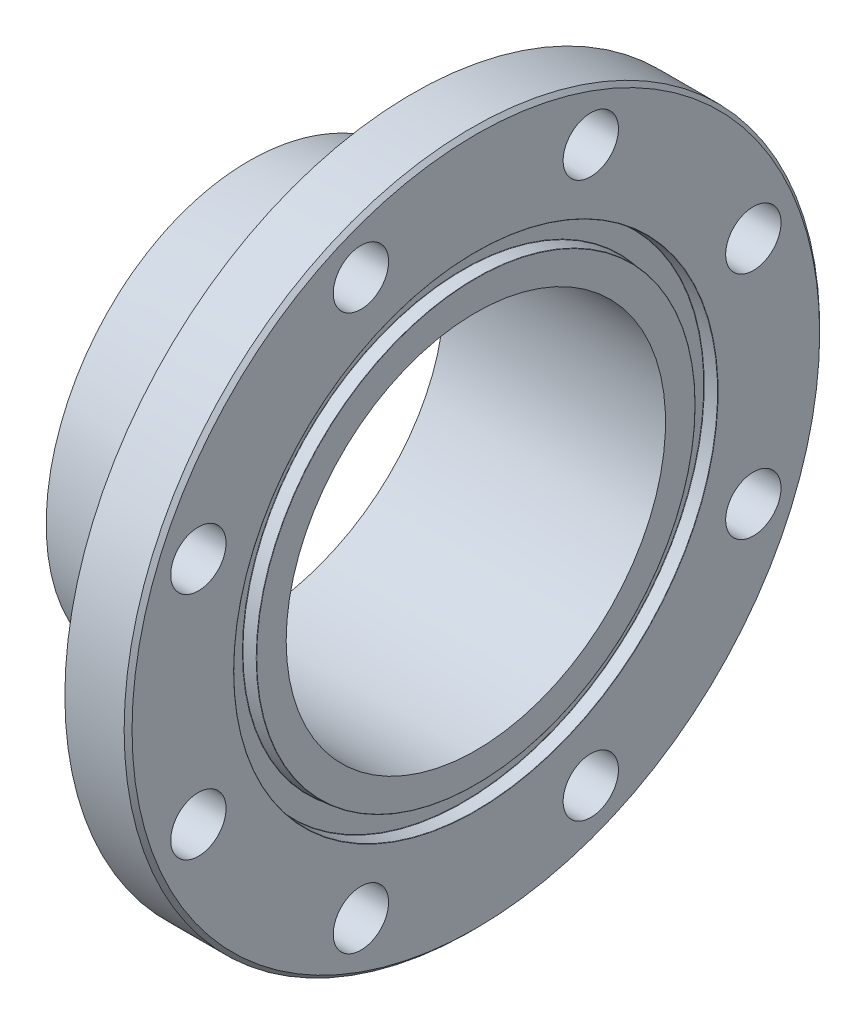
ISO-10303-21;
HEADER;
FILE_DESCRIPTION(('STEP AP214'),'2;1');
FILE_NAME('part.step','',(''),(''),'','','');
FILE_SCHEMA(('AUTOMOTIVE_DESIGN { 1 0 10303 214 1 1 1 1 }'));
ENDSEC;
DATA;
#1=APPLICATION_CONTEXT('core data for automotive mechanical design processes');
#2=APPLICATION_PROTOCOL_DEFINITION('international standard','automotive_design',2000,#1);
#3=PRODUCT_CONTEXT('',#1,'mechanical');
#4=PRODUCT('Part','Part','',(#3));
#5=PRODUCT_RELATED_PRODUCT_CATEGORY('part','',(#4));
#6=PRODUCT_DEFINITION_FORMATION('','',#4);
#7=PRODUCT_DEFINITION_CONTEXT('part definition',#1,'design');
#8=PRODUCT_DEFINITION('design','',#6,#7);
#9=PRODUCT_DEFINITION_SHAPE('','',#8);
#10=(LENGTH_UNIT() NAMED_UNIT(*) SI_UNIT(.MILLI.,.METRE.));
#11=(NAMED_UNIT(*) PLANE_ANGLE_UNIT() SI_UNIT($,.RADIAN.));
#12=(NAMED_UNIT(*) SI_UNIT($,.STERADIAN.) SOLID_ANGLE_UNIT());
#13=UNCERTAINTY_MEASURE_WITH_UNIT(LENGTH_MEASURE(1.E-05),#10,'distance_accuracy_value','');
#14=(GEOMETRIC_REPRESENTATION_CONTEXT(3) GLOBAL_UNCERTAINTY_ASSIGNED_CONTEXT((#13)) GLOBAL_UNIT_ASSIGNED_CONTEXT((#10,
#11,#12)) REPRESENTATION_CONTEXT('',''));
#15=CARTESIAN_POINT('',(0.,0.,0.));
#16=DIRECTION('',(0.,0.,1.));
#17=DIRECTION('',(1.,0.,0.));
#18=AXIS2_PLACEMENT_3D('',#15,#16,#17);
#19=CARTESIAN_POINT('',(0.,0.,0.));
#20=DIRECTION('',(-1.,0.,0.));
#21=DIRECTION('',(0.,0.,1.));
#22=AXIS2_PLACEMENT_3D('',#19,#20,#21);
#23=CYLINDRICAL_SURFACE('',#22,76.2);
#24=CARTESIAN_POINT('',(19.05,0.,76.2));
#25=CARTESIAN_POINT('',(19.0500001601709,1.06962037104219,76.2000012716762));
#26=CARTESIAN_POINT('',(19.0488733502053,2.13920445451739,76.1774764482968));
#27=CARTESIAN_POINT('',(19.0443743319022,4.27656395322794,76.087417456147));
#28=CARTESIAN_POINT('',(19.0410019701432,5.34433923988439,76.0198802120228));
#29=CARTESIAN_POINT('',(19.0320346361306,7.47627389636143,75.8398968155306));
#30=CARTESIAN_POINT('',(19.0264392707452,8.54043259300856,75.7274427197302));
#31=CARTESIAN_POINT('',(19.0130650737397,10.663157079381,75.4578149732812));
#32=CARTESIAN_POINT('',(19.0052860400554,11.7217223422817,75.3006371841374));
#33=CARTESIAN_POINT('',(18.9875911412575,13.8323230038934,74.9416696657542));
#34=CARTESIAN_POINT('',(18.9776731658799,14.8843508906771,74.7398358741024));
#35=CARTESIAN_POINT('',(18.9557744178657,16.9790417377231,74.2919869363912));
#36=CARTESIAN_POINT('',(18.9437934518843,18.0217038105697,74.0459676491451));
#37=CARTESIAN_POINT('',(18.9178565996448,20.0955426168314,73.5102437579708));
#38=CARTESIAN_POINT('',(18.9039010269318,21.1267211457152,73.2205460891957));
#39=CARTESIAN_POINT('',(18.8741113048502,23.1760231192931,72.5979261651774));
#40=CARTESIAN_POINT('',(18.8582769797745,24.1941453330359,72.264999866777));
#41=CARTESIAN_POINT('',(18.824853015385,26.2148396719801,71.5567447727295));
#42=CARTESIAN_POINT('',(18.8072644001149,27.2174204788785,71.1814406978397));
#43=CARTESIAN_POINT('',(18.7704473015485,29.2059495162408,70.3889068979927));
#44=CARTESIAN_POINT('',(18.7512186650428,30.1918961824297,69.9716732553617));
#45=CARTESIAN_POINT('',(18.7112609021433,32.1452366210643,69.0960867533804));
#46=CARTESIAN_POINT('',(18.6905318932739,33.1126318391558,68.6377371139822));
#47=CARTESIAN_POINT('',(18.6477172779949,35.0273181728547,67.6806666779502));
#48=CARTESIAN_POINT('',(18.6256315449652,35.9746074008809,67.1819421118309));
#49=CARTESIAN_POINT('',(18.580268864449,37.8470133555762,66.1452055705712));
#50=CARTESIAN_POINT('',(18.5569923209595,38.7721374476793,65.6072068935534));
#51=CARTESIAN_POINT('',(18.5094064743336,40.5989190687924,64.4927369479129));
#52=CARTESIAN_POINT('',(18.4850970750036,41.5005743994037,63.916262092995));
#53=CARTESIAN_POINT('',(18.4108804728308,44.1677332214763,62.1307234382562));
#54=CARTESIAN_POINT('',(18.3596723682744,45.8959395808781,60.8652630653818));
#55=CARTESIAN_POINT('',(18.2552173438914,49.2409447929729,58.1924256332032));
#56=CARTESIAN_POINT('',(18.2019686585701,50.8576436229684,56.7849238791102));
#57=CARTESIAN_POINT('',(18.0949770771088,53.9668181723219,53.8387273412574));
#58=CARTESIAN_POINT('',(18.0412341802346,55.4592937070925,52.3000323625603));
#59=CARTESIAN_POINT('',(17.934777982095,58.309412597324,49.102341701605));
#60=CARTESIAN_POINT('',(17.8820647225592,59.6670504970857,47.4433411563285));
#61=CARTESIAN_POINT('',(17.7791649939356,62.23781424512,44.0168357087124));
#62=CARTESIAN_POINT('',(17.7289785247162,63.4509401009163,42.249330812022));
#63=CARTESIAN_POINT('',(17.6325326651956,65.724632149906,38.6174209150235));
#64=CARTESIAN_POINT('',(17.5862752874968,66.7851203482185,36.752967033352));
#65=CARTESIAN_POINT('',(17.4990317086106,68.7452459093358,32.9412208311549));
#66=CARTESIAN_POINT('',(17.4580455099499,69.6448831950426,30.9939284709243));
#67=CARTESIAN_POINT('',(17.38251119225,71.2768765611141,27.0303563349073));
#68=CARTESIAN_POINT('',(17.347963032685,72.0092336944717,25.0140769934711));
#69=CARTESIAN_POINT('',(17.2862887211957,73.3014331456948,20.9268644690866));
#70=CARTESIAN_POINT('',(17.2591625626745,73.8612756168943,18.8559313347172));
#71=CARTESIAN_POINT('',(17.2131250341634,74.8040347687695,14.6759265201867));
#72=CARTESIAN_POINT('',(17.1942067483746,75.187100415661,12.5668885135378));
#73=CARTESIAN_POINT('',(17.1650904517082,75.7742569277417,8.32398482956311));
#74=CARTESIAN_POINT('',(17.1548924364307,75.9783478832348,6.19011916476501));
#75=CARTESIAN_POINT('',(17.1435072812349,76.2060900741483,1.91277189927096));
#76=CARTESIAN_POINT('',(17.1423200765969,76.2297426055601,-0.230709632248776));
#77=CARTESIAN_POINT('',(17.1489902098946,76.096441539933,-4.51203468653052));
#78=CARTESIAN_POINT('',(17.1568475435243,75.9394880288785,-6.64987821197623));
#79=CARTESIAN_POINT('',(17.1813717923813,75.4463235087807,-10.9027873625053));
#80=CARTESIAN_POINT('',(17.1980307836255,75.1102737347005,-13.0178717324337));
#81=CARTESIAN_POINT('',(17.2396798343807,74.2614227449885,-17.2121843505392));
#82=CARTESIAN_POINT('',(17.2646698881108,73.7486216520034,-19.2914126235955));
#83=CARTESIAN_POINT('',(17.3222710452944,72.5499309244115,-23.3992598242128));
#84=CARTESIAN_POINT('',(17.3548821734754,71.8640407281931,-25.4278785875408));
#85=CARTESIAN_POINT('',(17.4267994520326,70.3240655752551,-29.4201152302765));
#86=CARTESIAN_POINT('',(17.4661056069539,69.46998050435,-31.3837330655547));
#87=CARTESIAN_POINT('',(17.5503168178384,67.5992736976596,-35.2329281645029));
#88=CARTESIAN_POINT('',(17.595224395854,66.5825786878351,-37.1184697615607));
#89=CARTESIAN_POINT('',(17.6893503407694,64.3941588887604,-40.7972168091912));
#90=CARTESIAN_POINT('',(17.7385687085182,63.2224340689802,-42.59042224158));
#91=CARTESIAN_POINT('',(17.8399212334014,60.7322645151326,-46.0718171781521));
#92=CARTESIAN_POINT('',(17.8920554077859,59.4138189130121,-47.7600060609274));
#93=CARTESIAN_POINT('',(17.9977623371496,56.6395572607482,-51.0194142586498));
#94=CARTESIAN_POINT('',(18.0513350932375,55.1837411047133,-52.5906334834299));
#95=CARTESIAN_POINT('',(18.1584610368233,52.1433753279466,-55.6066404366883));
#96=CARTESIAN_POINT('',(18.2120141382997,50.5586861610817,-57.0512874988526));
#97=CARTESIAN_POINT('',(18.3175225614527,47.273199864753,-59.8019626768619));
#98=CARTESIAN_POINT('',(18.3694778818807,45.5724026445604,-61.1079906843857));
#99=CARTESIAN_POINT('',(18.470316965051,42.0667581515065,-63.5721500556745));
#100=CARTESIAN_POINT('',(18.5192007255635,40.2619108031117,-64.7302813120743));
#101=CARTESIAN_POINT('',(18.6125098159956,36.5609696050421,-66.8904049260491));
#102=CARTESIAN_POINT('',(18.6569351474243,34.6648757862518,-67.8923973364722));
#103=CARTESIAN_POINT('',(18.7400680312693,30.7948402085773,-69.7331292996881));
#104=CARTESIAN_POINT('',(18.7787754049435,28.8208960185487,-70.5718637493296));
#105=CARTESIAN_POINT('',(18.8493718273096,24.8092431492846,-72.0800488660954));
#106=CARTESIAN_POINT('',(18.8812608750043,22.7715344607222,-72.7494995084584));
#107=CARTESIAN_POINT('',(18.9373147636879,18.6468637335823,-73.9143211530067));
#108=CARTESIAN_POINT('',(18.9614796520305,16.55990199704,-74.4096932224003));
#109=CARTESIAN_POINT('',(19.0013988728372,12.3515785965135,-75.2228108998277));
#110=CARTESIAN_POINT('',(19.0171532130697,10.2302169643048,-75.5405566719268));
#111=CARTESIAN_POINT('',(19.0397913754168,5.9705219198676,-75.995894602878));
#112=CARTESIAN_POINT('',(19.0466847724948,3.83220934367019,-76.133681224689));
#113=CARTESIAN_POINT('',(19.0514369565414,-0.448433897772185,-76.2287487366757));
#114=CARTESIAN_POINT('',(19.0492957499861,-2.59076456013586,-76.1860297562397));
#115=CARTESIAN_POINT('',(19.0360394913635,-6.86418936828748,-75.9203930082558));
#116=CARTESIAN_POINT('',(19.0249244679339,-8.99528354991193,-75.6974758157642));
#117=CARTESIAN_POINT('',(18.9940358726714,-13.2310790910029,-75.0730412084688));
#118=CARTESIAN_POINT('',(18.9742623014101,-15.3357804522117,-74.6715238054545));
#119=CARTESIAN_POINT('',(18.9266294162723,-19.5027678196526,-73.6930122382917));
#120=CARTESIAN_POINT('',(18.8987742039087,-21.5650747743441,-73.1161070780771));
#121=CARTESIAN_POINT('',(18.8357629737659,-25.6337366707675,-71.7908706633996));
#122=CARTESIAN_POINT('',(18.8006069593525,-27.6400916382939,-71.0425394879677));
#123=CARTESIAN_POINT('',(18.7239890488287,-31.5826375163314,-69.3797819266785));
#124=CARTESIAN_POINT('',(18.6825271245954,-33.5188281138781,-68.4653548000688));
#125=CARTESIAN_POINT('',(18.594470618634,-37.3073282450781,-66.4769127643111));
#126=CARTESIAN_POINT('',(18.5478760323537,-39.159637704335,-65.402897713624));
#127=CARTESIAN_POINT('',(18.4508305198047,-42.7688189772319,-63.1019192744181));
#128=CARTESIAN_POINT('',(18.4003763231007,-44.5256076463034,-61.8748256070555));
#129=CARTESIAN_POINT('',(18.297075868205,-47.9295939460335,-59.2771273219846));
#130=CARTESIAN_POINT('',(18.244229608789,-49.5767915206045,-57.9065226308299));
#131=CARTESIAN_POINT('',(18.1376417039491,-52.7499426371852,-55.0315111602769));
#132=CARTESIAN_POINT('',(18.0839000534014,-54.2758954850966,-53.5271036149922));
#133=CARTESIAN_POINT('',(17.9770442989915,-57.195739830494,-50.3951486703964));
#134=CARTESIAN_POINT('',(17.923930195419,-58.589631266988,-48.7676012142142));
#135=CARTESIAN_POINT('',(17.8197888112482,-61.2366466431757,-45.3993947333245));
#136=CARTESIAN_POINT('',(17.7687634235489,-62.4896446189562,-43.6586366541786));
#137=CARTESIAN_POINT('',(17.6702991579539,-64.8445374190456,-40.0776522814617));
#138=CARTESIAN_POINT('',(17.6228602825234,-65.9464321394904,-38.2374259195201));
#139=CARTESIAN_POINT('',(17.5329180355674,-67.9912658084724,-34.470572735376));
#140=CARTESIAN_POINT('',(17.4904146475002,-68.9342052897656,-32.5439462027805));
#141=CARTESIAN_POINT('',(17.4115527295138,-70.6544026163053,-28.6179744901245));
#142=CARTESIAN_POINT('',(17.3751941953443,-71.4316605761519,-26.6186293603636));
#143=CARTESIAN_POINT('',(17.3096728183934,-72.8146133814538,-22.5623878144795));
#144=CARTESIAN_POINT('',(17.2805066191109,-73.4203882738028,-20.5055187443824));
#145=CARTESIAN_POINT('',(17.2301784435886,-74.4565222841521,-16.347965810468));
#146=CARTESIAN_POINT('',(17.2090164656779,-74.88688143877,-14.2472819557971));
#147=CARTESIAN_POINT('',(17.1752998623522,-75.5690967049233,-10.0170672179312));
#148=CARTESIAN_POINT('',(17.1627451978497,-75.8209536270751,-7.88753646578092));
#149=CARTESIAN_POINT('',(17.1466010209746,-76.1443595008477,-3.6147939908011));
#150=CARTESIAN_POINT('',(17.1430115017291,-76.2159085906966,-1.47158227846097));
#151=CARTESIAN_POINT('',(17.1448988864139,-76.178206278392,2.81089507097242));
#152=CARTESIAN_POINT('',(17.1503658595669,-76.069152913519,4.95016245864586));
#153=CARTESIAN_POINT('',(17.1701917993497,-75.6714030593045,9.21188799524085));
#154=CARTESIAN_POINT('',(17.1845507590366,-75.382706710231,11.334346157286));
#155=CARTESIAN_POINT('',(17.2217522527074,-74.6277377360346,15.5473680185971));
#156=CARTESIAN_POINT('',(17.2445947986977,-74.161464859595,17.6379316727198));
#157=CARTESIAN_POINT('',(17.2981140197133,-73.0546780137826,21.7723116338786));
#158=CARTESIAN_POINT('',(17.3287906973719,-72.4141639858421,23.8161279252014));
#159=CARTESIAN_POINT('',(17.3971068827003,-70.9634625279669,27.8425229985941));
#160=CARTESIAN_POINT('',(17.4347464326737,-70.1532740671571,29.8251014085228));
#161=CARTESIAN_POINT('',(17.5159195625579,-68.3690049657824,33.7149506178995));
#162=CARTESIAN_POINT('',(17.5594531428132,-67.3949243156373,35.6222214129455));
#163=CARTESIAN_POINT('',(17.651178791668,-65.2898121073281,39.3479107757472));
#164=CARTESIAN_POINT('',(17.699370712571,-64.1587855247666,41.166332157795));
#165=CARTESIAN_POINT('',(17.7990460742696,-61.7478585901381,44.7014555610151));
#166=CARTESIAN_POINT('',(17.8505295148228,-60.4679582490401,46.4181575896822));
#167=CARTESIAN_POINT('',(17.9553908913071,-57.7667507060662,49.7395961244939));
#168=CARTESIAN_POINT('',(18.0087706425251,-56.3453055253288,51.3442207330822));
#169=CARTESIAN_POINT('',(18.0890714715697,-54.1159890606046,53.6567584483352));
#170=CARTESIAN_POINT('',(18.1158806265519,-53.3565817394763,54.4119678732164));
#171=CARTESIAN_POINT('',(18.1693891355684,-51.8066356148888,55.8896990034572));
#172=CARTESIAN_POINT('',(18.1960884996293,-51.0160997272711,56.6122237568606));
#173=CARTESIAN_POINT('',(18.2491973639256,-49.405010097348,58.0235503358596));
#174=CARTESIAN_POINT('',(18.2756067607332,-48.5844460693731,58.7123404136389));
#175=CARTESIAN_POINT('',(18.3279368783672,-46.9150753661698,60.0546642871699));
#176=CARTESIAN_POINT('',(18.3538576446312,-46.0662713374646,60.7082013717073));
#177=CARTESIAN_POINT('',(18.4050308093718,-44.341789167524,61.9789723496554));
#178=CARTESIAN_POINT('',(18.4302831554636,-43.4661089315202,62.5962034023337));
#179=CARTESIAN_POINT('',(18.4799357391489,-41.6895722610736,63.7931551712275));
#180=CARTESIAN_POINT('',(18.5043360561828,-40.7887181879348,64.3728793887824));
#181=CARTESIAN_POINT('',(18.5521383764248,-38.9624129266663,65.4944263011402));
#182=CARTESIAN_POINT('',(18.5755393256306,-38.036937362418,66.0362093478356));
#183=CARTESIAN_POINT('',(18.6211475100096,-36.1640132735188,67.0802018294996));
#184=CARTESIAN_POINT('',(18.6433548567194,-35.2165668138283,67.5824149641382));
#185=CARTESIAN_POINT('',(18.6864235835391,-33.3011490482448,68.5465041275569));
#186=CARTESIAN_POINT('',(18.7072847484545,-32.3331744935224,69.0083737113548));
#187=CARTESIAN_POINT('',(18.7475068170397,-30.3786610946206,69.8908187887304));
#188=CARTESIAN_POINT('',(18.7668678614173,-29.3921240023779,70.3113981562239));
#189=CARTESIAN_POINT('',(18.8039355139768,-27.4031449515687,71.1101611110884));
#190=CARTESIAN_POINT('',(18.8216437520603,-26.4007198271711,71.4883865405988));
#191=CARTESIAN_POINT('',(18.8553001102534,-24.3808835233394,72.2022142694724));
#192=CARTESIAN_POINT('',(18.8712483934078,-23.3634737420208,72.537820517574));
#193=CARTESIAN_POINT('',(18.9012707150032,-21.3155624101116,73.165795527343));
#194=CARTESIAN_POINT('',(18.9153450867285,-20.2850632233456,73.4581719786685));
#195=CARTESIAN_POINT('',(18.9415219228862,-18.2127236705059,73.9992130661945));
#196=CARTESIAN_POINT('',(18.9536245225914,-17.1708840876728,74.2478807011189));
#197=CARTESIAN_POINT('',(18.9787005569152,-14.8008926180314,74.7609966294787));
#198=CARTESIAN_POINT('',(18.9910585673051,-13.4698534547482,75.0122417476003));
#199=CARTESIAN_POINT('',(19.0123422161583,-10.796573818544,75.44340124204));
#200=CARTESIAN_POINT('',(19.0212686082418,-9.45433587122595,75.6233312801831));
#201=CARTESIAN_POINT('',(19.0355921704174,-6.76216290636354,75.911434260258));
#202=CARTESIAN_POINT('',(19.0409893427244,-5.41222789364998,76.0196072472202));
#203=CARTESIAN_POINT('',(19.0481935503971,-2.70817643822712,76.1638972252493));
#204=CARTESIAN_POINT('',(19.0499997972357,-1.35405914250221,76.1999983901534));
#205=CARTESIAN_POINT('',(19.05,0.,76.2));
#206=B_SPLINE_CURVE_WITH_KNOTS('',3,(#24,#25,#26,#27,#28,#29,#30,#31,#32,#33,#34,#35,#36,#37,
#38,#39,#40,#41,#42,#43,#44,#45,#46,#47,#48,#49,#50,#51,#52,#53,#54,#55,#56,#57,#58,#59,#60,#61,
#62,#63,#64,#65,#66,#67,#68,#69,#70,#71,#72,#73,#74,#75,#76,#77,#78,#79,#80,#81,#82,#83,#84,#85,
#86,#87,#88,#89,#90,#91,#92,#93,#94,#95,#96,#97,#98,#99,#100,#101,#102,#103,#104,#105,#106,#107,
#108,#109,#110,#111,#112,#113,#114,#115,#116,#117,#118,#119,#120,#121,#122,#123,#124,#125,#126,
#127,#128,#129,#130,#131,#132,#133,#134,#135,#136,#137,#138,#139,#140,#141,#142,#143,#144,#145,
#146,#147,#148,#149,#150,#151,#152,#153,#154,#155,#156,#157,#158,#159,#160,#161,#162,#163,#164,
#165,#166,#167,#168,#169,#170,#171,#172,#173,#174,#175,#176,#177,#178,#179,#180,#181,#182,#183,
#184,#185,#186,#187,#188,#189,#190,#191,#192,#193,#194,#195,#196,#197,#198,#199,#200,#201,#202,
#203,#204,#205),.UNSPECIFIED.,.T.,.F.,(4,2,2,2,2,2,2,2,2,2,2,2,2,2,2,2,2,2,2,2,2,2,2,2,2,2,2,2,
2,2,2,2,2,2,2,2,2,2,2,2,2,2,2,2,2,2,2,2,2,2,2,2,2,2,2,2,2,2,2,2,2,2,2,2,2,2,2,2,2,2,2,2,2,2,2,2,
2,2,2,2,2,2,2,2,2,2,2,2,2,2,4),(0.,3.2085606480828,6.41734053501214,9.6266881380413,
12.8363328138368,16.0491587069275,19.2622858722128,22.4749034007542,25.6878216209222,
28.8988751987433,32.1102290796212,35.3213316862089,38.5327344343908,41.743054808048,
44.9536748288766,51.37317090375,57.7983523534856,64.2235433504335,70.6489942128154,
77.0744447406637,83.5031669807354,89.9318923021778,96.3605771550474,102.789256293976,
109.212508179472,115.63575682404,122.058959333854,128.482158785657,134.899585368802,
141.317007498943,147.73445045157,154.151897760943,160.572245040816,166.992593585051,
173.412980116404,179.833371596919,186.260810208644,192.688253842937,199.115702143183,
205.543148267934,211.970795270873,218.398443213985,224.826051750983,231.253654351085,
237.674305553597,244.094952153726,250.515578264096,256.936203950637,263.353576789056,
269.770946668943,276.188345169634,282.605749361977,289.028652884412,295.451559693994,
301.874503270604,308.297449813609,314.726093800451,321.154742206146,327.583369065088,
334.011991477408,340.437608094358,346.863223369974,353.288809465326,359.71439063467,
366.13293058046,372.551465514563,378.970009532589,385.388555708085,391.80714088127,
398.225726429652,404.64410853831,411.06249017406,417.487190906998,420.700419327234,
423.913347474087,427.12738665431,430.341125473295,433.555115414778,436.768804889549,
439.985804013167,443.20250199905,446.419712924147,449.636621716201,452.850323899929,
456.063728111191,459.276560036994,462.489171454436,466.550971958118,470.611879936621,
474.672785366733,478.734582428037),.UNSPECIFIED.);
#207=CARTESIAN_POINT('',(19.05,0.,76.2));
#208=VERTEX_POINT('',#207);
#209=EDGE_CURVE('E68',#208,#208,#206,.T.);
#210=ORIENTED_EDGE('',*,*,#209,.T.);
#211=EDGE_LOOP('',(#210));
#212=FACE_BOUND('',#211,.T.);
#213=CARTESIAN_POINT('',(107.95,0.,0.));
#214=DIRECTION('',(-1.,0.,0.));
#215=DIRECTION('',(0.,0.,1.));
#216=AXIS2_PLACEMENT_3D('',#213,#214,#215);
#217=CIRCLE('',#216,76.2);
#218=CARTESIAN_POINT('',(107.95,0.,76.2));
#219=VERTEX_POINT('',#218);
#220=EDGE_CURVE('E51',#219,#219,#217,.T.);
#221=ORIENTED_EDGE('',*,*,#220,.F.);
#222=EDGE_LOOP('',(#221));
#223=FACE_BOUND('',#222,.T.);
#224=ADVANCED_FACE('F31',(#212,#223),#23,.F.);
#225=CARTESIAN_POINT('',(107.95,0.,-76.2));
#226=DIRECTION('',(-1.,0.,0.));
#227=DIRECTION('',(0.,0.,1.));
#228=AXIS2_PLACEMENT_3D('',#225,#226,#227);
#229=PLANE('',#228);
#230=CARTESIAN_POINT('',(107.95,0.,0.));
#231=DIRECTION('',(-1.,0.,0.));
#232=DIRECTION('',(0.,0.,1.));
#233=AXIS2_PLACEMENT_3D('',#230,#231,#232);
#234=CIRCLE('',#233,88.0194613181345);
#235=CARTESIAN_POINT('',(107.95,0.,88.0194613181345));
#236=VERTEX_POINT('',#235);
#237=EDGE_CURVE('E145',#236,#236,#234,.T.);
#238=ORIENTED_EDGE('',*,*,#237,.F.);
#239=EDGE_LOOP('',(#238));
#240=FACE_BOUND('',#239,.T.);
#241=ORIENTED_EDGE('',*,*,#220,.T.);
#242=EDGE_LOOP('',(#241));
#243=FACE_BOUND('',#242,.T.);
#244=ADVANCED_FACE('F95',(#240,#243),#229,.F.);
#245=CARTESIAN_POINT('',(107.823,0.,0.));
#246=DIRECTION('',(-1.,0.,0.));
#247=DIRECTION('',(0.,0.,1.));
#248=AXIS2_PLACEMENT_3D('',#245,#246,#247);
#249=TOROIDAL_SURFACE('',#248,88.0194613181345,0.127000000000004);
#250=CARTESIAN_POINT('',(107.834068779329,0.,0.));
#251=DIRECTION('',(-1.,0.,0.));
#252=DIRECTION('',(0.,0.,1.));
#253=AXIS2_PLACEMENT_3D('',#250,#251,#252);
#254=CIRCLE('',#253,88.1459780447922);
#255=CARTESIAN_POINT('',(107.834068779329,0.,88.1459780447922));
#256=VERTEX_POINT('',#255);
#257=EDGE_CURVE('E143',#256,#256,#254,.T.);
#258=ORIENTED_EDGE('',*,*,#257,.F.);
#259=EDGE_LOOP('',(#258));
#260=FACE_BOUND('',#259,.T.);
#261=ORIENTED_EDGE('',*,*,#237,.T.);
#262=EDGE_LOOP('',(#261));
#263=FACE_BOUND('',#262,.T.);
#264=ADVANCED_FACE('F154',(#260,#263),#249,.T.);
#265=CARTESIAN_POINT('',(107.834068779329,0.,0.));
#266=DIRECTION('',(-1.,0.,0.));
#267=DIRECTION('',(0.,0.,1.));
#268=AXIS2_PLACEMENT_3D('',#265,#266,#267);
#269=CONICAL_SURFACE('',#268,88.1459780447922,0.087266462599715);
#270=CARTESIAN_POINT('',(102.960531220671,0.,0.));
#271=DIRECTION('',(-1.,0.,0.));
#272=DIRECTION('',(0.,0.,1.));
#273=AXIS2_PLACEMENT_3D('',#270,#271,#272);
#274=CIRCLE('',#273,88.5723573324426);
#275=CARTESIAN_POINT('',(102.960531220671,0.,88.5723573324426));
#276=VERTEX_POINT('',#275);
#277=EDGE_CURVE('E140',#276,#276,#274,.T.);
#278=ORIENTED_EDGE('',*,*,#277,.F.);
#279=EDGE_LOOP('',(#278));
#280=FACE_BOUND('',#279,.T.);
#281=ORIENTED_EDGE('',*,*,#257,.T.);
#282=EDGE_LOOP('',(#281));
#283=FACE_BOUND('',#282,.T.);
#284=ADVANCED_FACE('F159',(#280,#283),#269,.T.);
#285=CARTESIAN_POINT('',(102.9716,0.,0.));
#286=DIRECTION('',(-1.,0.,0.));
#287=DIRECTION('',(0.,0.,1.));
#288=AXIS2_PLACEMENT_3D('',#285,#286,#287);
#289=TOROIDAL_SURFACE('',#288,88.6988740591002,0.127000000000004);
#290=CARTESIAN_POINT('',(102.8446,0.,0.));
#291=DIRECTION('',(-1.,0.,0.));
#292=DIRECTION('',(0.,0.,1.));
#293=AXIS2_PLACEMENT_3D('',#290,#291,#292);
#294=CIRCLE('',#293,88.6988740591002);
#295=CARTESIAN_POINT('',(102.8446,0.,88.6988740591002));
#296=VERTEX_POINT('',#295);
#297=EDGE_CURVE('E137',#296,#296,#294,.T.);
#298=ORIENTED_EDGE('',*,*,#297,.F.);
#299=EDGE_LOOP('',(#298));
#300=FACE_BOUND('',#299,.T.);
#301=ORIENTED_EDGE('',*,*,#277,.T.);
#302=EDGE_LOOP('',(#301));
#303=FACE_BOUND('',#302,.T.);
#304=ADVANCED_FACE('F164',(#300,#303),#289,.F.);
#305=CARTESIAN_POINT('',(102.8446,0.,-88.6988740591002));
#306=DIRECTION('',(-1.,0.,0.));
#307=DIRECTION('',(0.,0.,1.));
#308=AXIS2_PLACEMENT_3D('',#305,#306,#307);
#309=PLANE('',#308);
#310=CARTESIAN_POINT('',(102.8446,0.,0.));
#311=DIRECTION('',(-1.,0.,0.));
#312=DIRECTION('',(0.,0.,1.));
#313=AXIS2_PLACEMENT_3D('',#310,#311,#312);
#314=CIRCLE('',#313,96.6449259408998);
#315=CARTESIAN_POINT('',(102.8446,0.,96.6449259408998));
#316=VERTEX_POINT('',#315);
#317=EDGE_CURVE('E134',#316,#316,#314,.T.);
#318=ORIENTED_EDGE('',*,*,#317,.F.);
#319=EDGE_LOOP('',(#318));
#320=FACE_BOUND('',#319,.T.);
#321=ORIENTED_EDGE('',*,*,#297,.T.);
#322=EDGE_LOOP('',(#321));
#323=FACE_BOUND('',#322,.T.);
#324=ADVANCED_FACE('F171',(#320,#323),#309,.F.);
#325=CARTESIAN_POINT('',(102.9716,0.,0.));
#326=DIRECTION('',(-1.,0.,0.));
#327=DIRECTION('',(0.,0.,1.));
#328=AXIS2_PLACEMENT_3D('',#325,#326,#327);
#329=TOROIDAL_SURFACE('',#328,96.6449259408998,0.127000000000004);
#330=CARTESIAN_POINT('',(102.960531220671,0.,0.));
#331=DIRECTION('',(-1.,0.,0.));
#332=DIRECTION('',(0.,0.,1.));
#333=AXIS2_PLACEMENT_3D('',#330,#331,#332);
#334=CIRCLE('',#333,96.7714426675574);
#335=CARTESIAN_POINT('',(102.960531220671,0.,96.7714426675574));
#336=VERTEX_POINT('',#335);
#337=EDGE_CURVE('E129',#336,#336,#334,.T.);
#338=ORIENTED_EDGE('',*,*,#337,.F.);
#339=EDGE_LOOP('',(#338));
#340=FACE_BOUND('',#339,.T.);
#341=ORIENTED_EDGE('',*,*,#317,.T.);
#342=EDGE_LOOP('',(#341));
#343=FACE_BOUND('',#342,.T.);
#344=ADVANCED_FACE('F175',(#340,#343),#329,.F.);
#345=CARTESIAN_POINT('',(102.960531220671,0.,0.));
#346=DIRECTION('',(1.,0.,0.));
#347=DIRECTION('',(0.,0.,-1.));
#348=AXIS2_PLACEMENT_3D('',#345,#346,#347);
#349=CONICAL_SURFACE('',#348,96.7714426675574,0.0872664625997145);
#350=CARTESIAN_POINT('',(107.834068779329,0.,0.));
#351=DIRECTION('',(-1.,0.,0.));
#352=DIRECTION('',(0.,0.,1.));
#353=AXIS2_PLACEMENT_3D('',#350,#351,#352);
#354=CIRCLE('',#353,97.1978219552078);
#355=CARTESIAN_POINT('',(107.834068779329,0.,97.1978219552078));
#356=VERTEX_POINT('',#355);
#357=EDGE_CURVE('E125',#356,#356,#354,.T.);
#358=ORIENTED_EDGE('',*,*,#357,.F.);
#359=EDGE_LOOP('',(#358));
#360=FACE_BOUND('',#359,.T.);
#361=ORIENTED_EDGE('',*,*,#337,.T.);
#362=EDGE_LOOP('',(#361));
#363=FACE_BOUND('',#362,.T.);
#364=ADVANCED_FACE('F179',(#360,#363),#349,.F.);
#365=CARTESIAN_POINT('',(107.823,0.,0.));
#366=DIRECTION('',(-1.,0.,0.));
#367=DIRECTION('',(0.,0.,1.));
#368=AXIS2_PLACEMENT_3D('',#365,#366,#367);
#369=TOROIDAL_SURFACE('',#368,97.3243386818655,0.127000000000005);
#370=CARTESIAN_POINT('',(107.95,0.,0.));
#371=DIRECTION('',(-1.,0.,0.));
#372=DIRECTION('',(0.,0.,1.));
#373=AXIS2_PLACEMENT_3D('',#370,#371,#372);
#374=CIRCLE('',#373,97.3243386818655);
#375=CARTESIAN_POINT('',(107.95,0.,97.3243386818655));
#376=VERTEX_POINT('',#375);
#377=EDGE_CURVE('E123',#376,#376,#374,.T.);
#378=ORIENTED_EDGE('',*,*,#377,.F.);
#379=EDGE_LOOP('',(#378));
#380=FACE_BOUND('',#379,.T.);
#381=ORIENTED_EDGE('',*,*,#357,.T.);
#382=EDGE_LOOP('',(#381));
#383=FACE_BOUND('',#382,.T.);
#384=ADVANCED_FACE('F183',(#380,#383),#369,.T.);
#385=CARTESIAN_POINT('',(107.95,0.,-97.3243386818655));
#386=DIRECTION('',(-1.,0.,0.));
#387=DIRECTION('',(0.,0.,1.));
#388=AXIS2_PLACEMENT_3D('',#385,#386,#387);
#389=PLANE('',#388);
#390=CARTESIAN_POINT('',(107.95,0.,0.));
#391=DIRECTION('',(-1.,0.,0.));
#392=DIRECTION('',(0.,0.,1.));
#393=AXIS2_PLACEMENT_3D('',#390,#391,#392);
#394=CIRCLE('',#393,138.1125);
#395=CARTESIAN_POINT('',(107.95,0.,138.1125));
#396=VERTEX_POINT('',#395);
#397=EDGE_CURVE('E42',#396,#396,#394,.F.);
#398=ORIENTED_EDGE('',*,*,#397,.T.);
#399=EDGE_LOOP('',(#398));
#400=FACE_BOUND('',#399,.T.);
#401=CARTESIAN_POINT('',(107.95,111.466065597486,46.1707561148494));
#402=DIRECTION('',(1.,0.,0.));
#403=DIRECTION('',(0.,0.,-1.));
#404=AXIS2_PLACEMENT_3D('',#401,#402,#403);
#405=CIRCLE('',#404,11.1125);
#406=CARTESIAN_POINT('',(107.95,111.466065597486,35.0582561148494));
#407=VERTEX_POINT('',#406);
#408=EDGE_CURVE('E56',#407,#407,#405,.T.);
#409=ORIENTED_EDGE('',*,*,#408,.F.);
#410=EDGE_LOOP('',(#409));
#411=FACE_BOUND('',#410,.T.);
#412=CARTESIAN_POINT('',(107.95,111.466065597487,-46.170756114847));
#413=DIRECTION('',(1.,0.,0.));
#414=DIRECTION('',(0.,0.,-1.));
#415=AXIS2_PLACEMENT_3D('',#412,#413,#414);
#416=CIRCLE('',#415,11.1125);
#417=CARTESIAN_POINT('',(107.95,111.466065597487,-57.283256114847));
#418=VERTEX_POINT('',#417);
#419=EDGE_CURVE('E55',#418,#418,#416,.T.);
#420=ORIENTED_EDGE('',*,*,#419,.F.);
#421=EDGE_LOOP('',(#420));
#422=FACE_BOUND('',#421,.T.);
#423=CARTESIAN_POINT('',(107.95,46.170756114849,-111.466065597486));
#424=DIRECTION('',(1.,0.,0.));
#425=DIRECTION('',(0.,0.,-1.));
#426=AXIS2_PLACEMENT_3D('',#423,#424,#425);
#427=CIRCLE('',#426,11.1125);
#428=CARTESIAN_POINT('',(107.95,46.170756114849,-122.578565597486));
#429=VERTEX_POINT('',#428);
#430=EDGE_CURVE('E60',#429,#429,#427,.T.);
#431=ORIENTED_EDGE('',*,*,#430,.F.);
#432=EDGE_LOOP('',(#431));
#433=FACE_BOUND('',#432,.T.);
#434=CARTESIAN_POINT('',(107.95,-46.1707561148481,-111.466065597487));
#435=DIRECTION('',(1.,0.,0.));
#436=DIRECTION('',(0.,0.,-1.));
#437=AXIS2_PLACEMENT_3D('',#434,#435,#436);
#438=CIRCLE('',#437,11.1125);
#439=CARTESIAN_POINT('',(107.95,-46.1707561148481,-122.578565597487));
#440=VERTEX_POINT('',#439);
#441=EDGE_CURVE('E240',#440,#440,#438,.T.);
#442=ORIENTED_EDGE('',*,*,#441,.F.);
#443=EDGE_LOOP('',(#442));
#444=FACE_BOUND('',#443,.T.);
#445=CARTESIAN_POINT('',(107.95,-111.466065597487,-46.1707561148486));
#446=DIRECTION('',(1.,0.,0.));
#447=DIRECTION('',(0.,0.,-1.));
#448=AXIS2_PLACEMENT_3D('',#445,#446,#447);
#449=CIRCLE('',#448,11.1125);
#450=CARTESIAN_POINT('',(107.95,-111.466065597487,-57.2832561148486));
#451=VERTEX_POINT('',#450);
#452=EDGE_CURVE('E236',#451,#451,#449,.T.);
#453=ORIENTED_EDGE('',*,*,#452,.F.);
#454=EDGE_LOOP('',(#453));
#455=FACE_BOUND('',#454,.T.);
#456=CARTESIAN_POINT('',(107.95,-111.466065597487,46.1707561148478));
#457=DIRECTION('',(1.,0.,0.));
#458=DIRECTION('',(0.,0.,-1.));
#459=AXIS2_PLACEMENT_3D('',#456,#457,#458);
#460=CIRCLE('',#459,11.1125);
#461=CARTESIAN_POINT('',(107.95,-111.466065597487,35.0582561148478));
#462=VERTEX_POINT('',#461);
#463=EDGE_CURVE('E232',#462,#462,#460,.T.);
#464=ORIENTED_EDGE('',*,*,#463,.F.);
#465=EDGE_LOOP('',(#464));
#466=FACE_BOUND('',#465,.T.);
#467=CARTESIAN_POINT('',(107.95,-46.1707561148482,111.466065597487));
#468=DIRECTION('',(1.,0.,0.));
#469=DIRECTION('',(0.,0.,-1.));
#470=AXIS2_PLACEMENT_3D('',#467,#468,#469);
#471=CIRCLE('',#470,11.1125);
#472=CARTESIAN_POINT('',(107.95,-46.1707561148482,100.353565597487));
#473=VERTEX_POINT('',#472);
#474=EDGE_CURVE('E226',#473,#473,#471,.T.);
#475=ORIENTED_EDGE('',*,*,#474,.F.);
#476=EDGE_LOOP('',(#475));
#477=FACE_BOUND('',#476,.T.);
#478=CARTESIAN_POINT('',(107.95,46.1707561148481,111.466065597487));
#479=DIRECTION('',(1.,0.,0.));
#480=DIRECTION('',(0.,0.,-1.));
#481=AXIS2_PLACEMENT_3D('',#478,#479,#480);
#482=CIRCLE('',#481,11.1125);
#483=CARTESIAN_POINT('',(107.95,46.1707561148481,100.353565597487));
#484=VERTEX_POINT('',#483);
#485=EDGE_CURVE('E222',#484,#484,#482,.T.);
#486=ORIENTED_EDGE('',*,*,#485,.F.);
#487=EDGE_LOOP('',(#486));
#488=FACE_BOUND('',#487,.T.);
#489=ORIENTED_EDGE('',*,*,#377,.T.);
#490=EDGE_LOOP('',(#489));
#491=FACE_BOUND('',#490,.T.);
#492=ADVANCED_FACE('F118',(#400,#411,#422,#433,#444,#455,#466,#477,#488,#491),#389,.F.);
#493=CARTESIAN_POINT('',(0.,0.,0.));
#494=DIRECTION('',(-1.,0.,0.));
#495=DIRECTION('',(0.,0.,1.));
#496=AXIS2_PLACEMENT_3D('',#493,#494,#495);
#497=CYLINDRICAL_SURFACE('',#496,139.7);
#498=CARTESIAN_POINT('',(106.3625,0.,0.));
#499=DIRECTION('',(-1.,0.,0.));
#500=DIRECTION('',(0.,0.,1.));
#501=AXIS2_PLACEMENT_3D('',#498,#499,#500);
#502=CIRCLE('',#501,139.7);
#503=CARTESIAN_POINT('',(106.3625,0.,139.7));
#504=VERTEX_POINT('',#503);
#505=EDGE_CURVE('E46',#504,#504,#502,.T.);
#506=ORIENTED_EDGE('',*,*,#505,.T.);
#507=EDGE_LOOP('',(#506));
#508=FACE_BOUND('',#507,.T.);
#509=CARTESIAN_POINT('',(82.55,0.,0.));
#510=DIRECTION('',(-1.,0.,0.));
#511=DIRECTION('',(0.,0.,1.));
#512=AXIS2_PLACEMENT_3D('',#509,#510,#511);
#513=CIRCLE('',#512,139.7);
#514=CARTESIAN_POINT('',(82.55,0.,139.7));
#515=VERTEX_POINT('',#514);
#516=EDGE_CURVE('E89',#515,#515,#513,.T.);
#517=ORIENTED_EDGE('',*,*,#516,.F.);
#518=EDGE_LOOP('',(#517));
#519=FACE_BOUND('',#518,.T.);
#520=ADVANCED_FACE('F114',(#508,#519),#497,.T.);
#521=CARTESIAN_POINT('',(82.55,0.,-139.7));
#522=DIRECTION('',(1.,0.,0.));
#523=DIRECTION('',(0.,0.,-1.));
#524=AXIS2_PLACEMENT_3D('',#521,#522,#523);
#525=PLANE('',#524);
#526=CARTESIAN_POINT('',(82.55,0.,0.));
#527=DIRECTION('',(1.,0.,0.));
#528=DIRECTION('',(0.,0.,-1.));
#529=AXIS2_PLACEMENT_3D('',#526,#527,#528);
#530=CIRCLE('',#529,103.199339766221);
#531=CARTESIAN_POINT('',(82.55,0.,-103.199339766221));
#532=VERTEX_POINT('',#531);
#533=EDGE_CURVE('E10',#532,#532,#530,.T.);
#534=ORIENTED_EDGE('',*,*,#533,.T.);
#535=EDGE_LOOP('',(#534));
#536=FACE_BOUND('',#535,.T.);
#537=CARTESIAN_POINT('',(82.55,111.466065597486,46.1707561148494));
#538=DIRECTION('',(1.,0.,0.));
#539=DIRECTION('',(0.,0.,-1.));
#540=AXIS2_PLACEMENT_3D('',#537,#538,#539);
#541=CIRCLE('',#540,11.1125);
#542=CARTESIAN_POINT('',(82.55,111.466065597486,35.0582561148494));
#543=VERTEX_POINT('',#542);
#544=EDGE_CURVE('E52',#543,#543,#541,.T.);
#545=ORIENTED_EDGE('',*,*,#544,.T.);
#546=EDGE_LOOP('',(#545));
#547=FACE_BOUND('',#546,.T.);
#548=CARTESIAN_POINT('',(82.55,111.466065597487,-46.170756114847));
#549=DIRECTION('',(1.,0.,0.));
#550=DIRECTION('',(0.,0.,-1.));
#551=AXIS2_PLACEMENT_3D('',#548,#549,#550);
#552=CIRCLE('',#551,11.1125);
#553=CARTESIAN_POINT('',(82.55,111.466065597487,-57.283256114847));
#554=VERTEX_POINT('',#553);
#555=EDGE_CURVE('E57',#554,#554,#552,.T.);
#556=ORIENTED_EDGE('',*,*,#555,.T.);
#557=EDGE_LOOP('',(#556));
#558=FACE_BOUND('',#557,.T.);
#559=CARTESIAN_POINT('',(82.55,46.170756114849,-111.466065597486));
#560=DIRECTION('',(1.,0.,0.));
#561=DIRECTION('',(0.,0.,-1.));
#562=AXIS2_PLACEMENT_3D('',#559,#560,#561);
#563=CIRCLE('',#562,11.1125);
#564=CARTESIAN_POINT('',(82.55,46.170756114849,-122.578565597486));
#565=VERTEX_POINT('',#564);
#566=EDGE_CURVE('E202',#565,#565,#563,.T.);
#567=ORIENTED_EDGE('',*,*,#566,.T.);
#568=EDGE_LOOP('',(#567));
#569=FACE_BOUND('',#568,.T.);
#570=CARTESIAN_POINT('',(82.55,-46.1707561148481,-111.466065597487));
#571=DIRECTION('',(1.,0.,0.));
#572=DIRECTION('',(0.,0.,-1.));
#573=AXIS2_PLACEMENT_3D('',#570,#571,#572);
#574=CIRCLE('',#573,11.1125);
#575=CARTESIAN_POINT('',(82.55,-46.1707561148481,-122.578565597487));
#576=VERTEX_POINT('',#575);
#577=EDGE_CURVE('E206',#576,#576,#574,.T.);
#578=ORIENTED_EDGE('',*,*,#577,.T.);
#579=EDGE_LOOP('',(#578));
#580=FACE_BOUND('',#579,.T.);
#581=CARTESIAN_POINT('',(82.55,-111.466065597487,-46.1707561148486));
#582=DIRECTION('',(1.,0.,0.));
#583=DIRECTION('',(0.,0.,-1.));
#584=AXIS2_PLACEMENT_3D('',#581,#582,#583);
#585=CIRCLE('',#584,11.1125);
#586=CARTESIAN_POINT('',(82.55,-111.466065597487,-57.2832561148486));
#587=VERTEX_POINT('',#586);
#588=EDGE_CURVE('E210',#587,#587,#585,.T.);
#589=ORIENTED_EDGE('',*,*,#588,.T.);
#590=EDGE_LOOP('',(#589));
#591=FACE_BOUND('',#590,.T.);
#592=CARTESIAN_POINT('',(82.55,-111.466065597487,46.1707561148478));
#593=DIRECTION('',(1.,0.,0.));
#594=DIRECTION('',(0.,0.,-1.));
#595=AXIS2_PLACEMENT_3D('',#592,#593,#594);
#596=CIRCLE('',#595,11.1125);
#597=CARTESIAN_POINT('',(82.55,-111.466065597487,35.0582561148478));
#598=VERTEX_POINT('',#597);
#599=EDGE_CURVE('E214',#598,#598,#596,.T.);
#600=ORIENTED_EDGE('',*,*,#599,.T.);
#601=EDGE_LOOP('',(#600));
#602=FACE_BOUND('',#601,.T.);
#603=CARTESIAN_POINT('',(82.55,-46.1707561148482,111.466065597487));
#604=DIRECTION('',(1.,0.,0.));
#605=DIRECTION('',(0.,0.,-1.));
#606=AXIS2_PLACEMENT_3D('',#603,#604,#605);
#607=CIRCLE('',#606,11.1125);
#608=CARTESIAN_POINT('',(82.55,-46.1707561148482,100.353565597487));
#609=VERTEX_POINT('',#608);
#610=EDGE_CURVE('E218',#609,#609,#607,.T.);
#611=ORIENTED_EDGE('',*,*,#610,.T.);
#612=EDGE_LOOP('',(#611));
#613=FACE_BOUND('',#612,.T.);
#614=CARTESIAN_POINT('',(82.55,46.1707561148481,111.466065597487));
#615=DIRECTION('',(1.,0.,0.));
#616=DIRECTION('',(0.,0.,-1.));
#617=AXIS2_PLACEMENT_3D('',#614,#615,#616);
#618=CIRCLE('',#617,11.1125);
#619=CARTESIAN_POINT('',(82.55,46.1707561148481,100.353565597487));
#620=VERTEX_POINT('',#619);
#621=EDGE_CURVE('E69',#620,#620,#618,.T.);
#622=ORIENTED_EDGE('',*,*,#621,.T.);
#623=EDGE_LOOP('',(#622));
#624=FACE_BOUND('',#623,.T.);
#625=ORIENTED_EDGE('',*,*,#516,.T.);
#626=EDGE_LOOP('',(#625));
#627=FACE_BOUND('',#626,.T.);
#628=ADVANCED_FACE('F117',(#536,#547,#558,#569,#580,#591,#602,#613,#624,#627),#525,.F.);
#629=CARTESIAN_POINT('',(82.55,0.,0.));
#630=DIRECTION('',(1.,0.,0.));
#631=DIRECTION('',(0.,0.,-1.));
#632=AXIS2_PLACEMENT_3D('',#629,#630,#631);
#633=CONICAL_SURFACE('',#632,95.25,0.179853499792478);
#634=CARTESIAN_POINT('',(74.7288837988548,0.,0.));
#635=DIRECTION('',(1.,0.,0.));
#636=DIRECTION('',(0.,0.,-1.));
#637=AXIS2_PLACEMENT_3D('',#634,#635,#636);
#638=CIRCLE('',#637,93.8279788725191);
#639=CARTESIAN_POINT('',(74.7288837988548,0.,-93.8279788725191));
#640=VERTEX_POINT('',#639);
#641=EDGE_CURVE('E38',#640,#640,#638,.F.);
#642=ORIENTED_EDGE('',*,*,#641,.T.);
#643=EDGE_LOOP('',(#642));
#644=FACE_BOUND('',#643,.T.);
#645=CARTESIAN_POINT('',(17.9069618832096,-59.0141823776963,-59.0679996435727));
#646=CARTESIAN_POINT('',(17.9388580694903,-58.1911040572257,-59.8985279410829));
#647=CARTESIAN_POINT('',(17.9707608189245,-57.3506076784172,-60.7117334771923));
#648=CARTESIAN_POINT('',(18.0343595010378,-55.6361083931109,-62.3021796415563));
#649=CARTESIAN_POINT('',(18.0660554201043,-54.762103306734,-63.0794179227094));
#650=CARTESIAN_POINT('',(18.1290189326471,-52.9820288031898,-64.5965835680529));
#651=CARTESIAN_POINT('',(18.1602864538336,-52.0759540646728,-65.3365046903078));
#652=CARTESIAN_POINT('',(18.2221696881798,-50.2333680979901,-66.7776375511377));
#653=CARTESIAN_POINT('',(18.2527853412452,-49.2968540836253,-67.4788457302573));
#654=CARTESIAN_POINT('',(18.3131734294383,-47.3942109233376,-68.8418537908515));
#655=CARTESIAN_POINT('',(18.3429450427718,-46.4280547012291,-69.5036159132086));
#656=CARTESIAN_POINT('',(18.4014061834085,-44.468574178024,-70.7858733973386));
#657=CARTESIAN_POINT('',(18.4300956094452,-43.4752473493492,-71.4063649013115));
#658=CARTESIAN_POINT('',(18.4861809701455,-41.4634174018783,-72.6047905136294));
#659=CARTESIAN_POINT('',(18.5135771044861,-40.4449182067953,-73.1827311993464));
#660=CARTESIAN_POINT('',(18.5668880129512,-38.3842971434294,-74.2951574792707));
#661=CARTESIAN_POINT('',(18.5928026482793,-37.3421730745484,-74.8296390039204));
#662=CARTESIAN_POINT('',(18.6429554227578,-35.2365557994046,-75.8539530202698));
#663=CARTESIAN_POINT('',(18.667194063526,-34.173069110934,-76.3437988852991));
#664=CARTESIAN_POINT('',(18.713832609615,-32.0262094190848,-77.2781659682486));
#665=CARTESIAN_POINT('',(18.7362323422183,-30.9428345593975,-77.7226829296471));
#666=CARTESIAN_POINT('',(18.7790287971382,-28.7583059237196,-78.565487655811));
#667=CARTESIAN_POINT('',(18.7994256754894,-27.657153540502,-78.9637790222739));
#668=CARTESIAN_POINT('',(18.8380743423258,-25.4388537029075,-79.7134708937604));
#669=CARTESIAN_POINT('',(18.8563259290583,-24.3217047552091,-80.0648669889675));
#670=CARTESIAN_POINT('',(18.890545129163,-22.0738697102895,-80.71996258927));
#671=CARTESIAN_POINT('',(18.9065135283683,-20.9431884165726,-81.0236785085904));
#672=CARTESIAN_POINT('',(18.9360610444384,-18.6699298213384,-81.5830118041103));
#673=CARTESIAN_POINT('',(18.9496399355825,-17.527351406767,-81.8386246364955));
#674=CARTESIAN_POINT('',(18.9866358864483,-14.0850629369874,-82.5324773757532));
#675=CARTESIAN_POINT('',(19.0063218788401,-11.7701708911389,-82.8979147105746));
#676=CARTESIAN_POINT('',(19.035092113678,-7.12789626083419,-83.4303765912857));
#677=CARTESIAN_POINT('',(19.0442209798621,-4.80060833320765,-83.5982363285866));
#678=CARTESIAN_POINT('',(19.0517747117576,-0.140064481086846,-83.7372043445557));
#679=CARTESIAN_POINT('',(19.0501995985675,2.19319143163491,-83.7083130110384));
#680=CARTESIAN_POINT('',(19.0363882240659,6.84895729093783,-83.4539638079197));
#681=CARTESIAN_POINT('',(19.0241517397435,9.17146701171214,-83.2285018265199));
#682=CARTESIAN_POINT('',(18.9893657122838,13.7891543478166,-82.5826833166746));
#683=CARTESIAN_POINT('',(18.9668161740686,16.084331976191,-82.1623268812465));
#684=CARTESIAN_POINT('',(18.9120959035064,20.6267441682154,-81.1307938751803));
#685=CARTESIAN_POINT('',(18.8799432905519,22.8740605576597,-80.519976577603));
#686=CARTESIAN_POINT('',(18.8069103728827,27.3092970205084,-79.1117535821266));
#687=CARTESIAN_POINT('',(18.7660300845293,29.497217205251,-78.3143482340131));
#688=CARTESIAN_POINT('',(18.6766943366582,33.7982796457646,-76.5387619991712));
#689=CARTESIAN_POINT('',(18.6282388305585,35.9114214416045,-75.56058000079));
#690=CARTESIAN_POINT('',(18.5251161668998,40.0481190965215,-73.4305390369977));
#691=CARTESIAN_POINT('',(18.4704489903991,42.0716746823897,-72.2786795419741));
#692=CARTESIAN_POINT('',(18.3562679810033,46.0209591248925,-69.8059178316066));
#693=CARTESIAN_POINT('',(18.2967402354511,47.9463795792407,-68.4845237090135));
#694=CARTESIAN_POINT('',(18.1746562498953,51.6794939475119,-65.6848983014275));
#695=CARTESIAN_POINT('',(18.11210000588,53.4871877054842,-64.2066668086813));
#696=CARTESIAN_POINT('',(17.9857153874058,56.9723461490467,-61.1039175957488));
#697=CARTESIAN_POINT('',(17.9218869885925,58.6498083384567,-59.4793970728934));
#698=CARTESIAN_POINT('',(17.7947483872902,61.862889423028,-56.0956495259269));
#699=CARTESIAN_POINT('',(17.7314381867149,63.3985077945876,-54.3364220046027));
#700=CARTESIAN_POINT('',(17.6067725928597,66.3251973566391,-50.6859069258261));
#701=CARTESIAN_POINT('',(17.5454295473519,67.715446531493,-48.7939598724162));
#702=CARTESIAN_POINT('',(17.4267892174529,70.3322676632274,-44.8999503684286));
#703=CARTESIAN_POINT('',(17.369491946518,71.5588390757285,-42.8978875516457));
#704=CARTESIAN_POINT('',(17.2605573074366,73.8398513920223,-38.7978022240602));
#705=CARTESIAN_POINT('',(17.2089200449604,74.8942890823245,-36.6997779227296));
#706=CARTESIAN_POINT('',(17.1127605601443,76.8237366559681,-32.4226295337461));
#707=CARTESIAN_POINT('',(17.0682383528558,77.6987461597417,-30.2435052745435));
#708=CARTESIAN_POINT('',(16.9873909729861,79.2666217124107,-25.8101528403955));
#709=CARTESIAN_POINT('',(16.9511012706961,79.9587016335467,-23.5556459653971));
#710=CARTESIAN_POINT('',(16.8879897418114,81.1510306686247,-18.996331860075));
#711=CARTESIAN_POINT('',(16.8611679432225,81.6512792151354,-16.6915244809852));
#712=CARTESIAN_POINT('',(16.8177523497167,82.4564779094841,-12.0479278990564));
#713=CARTESIAN_POINT('',(16.8011586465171,82.761426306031,-9.70913839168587));
#714=CARTESIAN_POINT('',(16.7786698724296,83.1739026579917,-5.01416451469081));
#715=CARTESIAN_POINT('',(16.7727748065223,83.2814305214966,-2.65798013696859));
#716=CARTESIAN_POINT('',(16.7718495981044,83.2983347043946,2.05935074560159));
#717=CARTESIAN_POINT('',(16.7768390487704,83.2073536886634,4.42049854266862));
#718=CARTESIAN_POINT('',(16.7975810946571,82.8271425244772,9.12673331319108));
#719=CARTESIAN_POINT('',(16.8133337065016,82.5379120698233,11.4718202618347));
#720=CARTESIAN_POINT('',(16.8551541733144,81.7632126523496,16.129274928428));
#721=CARTESIAN_POINT('',(16.881222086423,81.2777425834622,18.4416424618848));
#722=CARTESIAN_POINT('',(16.9429315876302,80.1139435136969,23.0171950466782));
#723=CARTESIAN_POINT('',(16.9785731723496,79.4356145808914,25.2803801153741));
#724=CARTESIAN_POINT('',(17.0584187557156,77.8907632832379,29.7416196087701));
#725=CARTESIAN_POINT('',(17.1026233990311,77.0242267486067,31.9396691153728));
#726=CARTESIAN_POINT('',(17.1983345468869,75.1090294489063,36.2547777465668));
#727=CARTESIAN_POINT('',(17.249841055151,74.060368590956,38.3718368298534));
#728=CARTESIAN_POINT('',(17.3586879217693,71.7882412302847,42.5098224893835));
#729=CARTESIAN_POINT('',(17.4160282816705,70.5647746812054,44.5307490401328));
#730=CARTESIAN_POINT('',(17.534906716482,67.9515912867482,48.461967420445));
#731=CARTESIAN_POINT('',(17.5964447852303,66.5618746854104,50.3722594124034));
#732=CARTESIAN_POINT('',(17.7218597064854,63.6282862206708,54.0654873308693));
#733=CARTESIAN_POINT('',(17.7857326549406,62.0846648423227,55.848622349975));
#734=CARTESIAN_POINT('',(17.9140877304,58.8522363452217,59.2780325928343));
#735=CARTESIAN_POINT('',(17.9785698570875,57.1634293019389,60.9243078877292));
#736=CARTESIAN_POINT('',(18.1062988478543,53.6525425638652,64.0680324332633));
#737=CARTESIAN_POINT('',(18.169545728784,51.8304646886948,65.5654837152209));
#738=CARTESIAN_POINT('',(18.2929926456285,48.0659055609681,68.4006515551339));
#739=CARTESIAN_POINT('',(18.353192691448,46.1234246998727,69.7383686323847));
#740=CARTESIAN_POINT('',(18.468582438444,42.139959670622,72.2391631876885));
#741=CARTESIAN_POINT('',(18.5237914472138,40.0994063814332,73.4029261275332));
#742=CARTESIAN_POINT('',(18.6278950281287,35.9270360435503,75.5537250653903));
#743=CARTESIAN_POINT('',(18.676789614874,33.7952192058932,76.5407614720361));
#744=CARTESIAN_POINT('',(18.76686301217,29.455573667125,78.3307960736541));
#745=CARTESIAN_POINT('',(18.8080420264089,27.2477469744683,79.1337991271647));
#746=CARTESIAN_POINT('',(18.8815038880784,22.7718455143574,80.549834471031));
#747=CARTESIAN_POINT('',(18.913786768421,20.5037709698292,81.1628674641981));
#748=CARTESIAN_POINT('',(18.9683796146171,15.9361307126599,82.1915881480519));
#749=CARTESIAN_POINT('',(18.9907427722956,13.6368028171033,82.6083291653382));
#750=CARTESIAN_POINT('',(19.0251143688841,9.01110629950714,83.2462875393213));
#751=CARTESIAN_POINT('',(19.0371228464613,6.6847377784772,83.467505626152));
#752=CARTESIAN_POINT('',(19.0504425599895,2.02164653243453,83.7127731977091));
#753=CARTESIAN_POINT('',(19.0517540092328,-0.315075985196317,83.7368266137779));
#754=CARTESIAN_POINT('',(19.0436427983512,-4.98219121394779,83.5875961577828));
#755=CARTESIAN_POINT('',(19.0342201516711,-7.31258393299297,83.4143125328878));
#756=CARTESIAN_POINT('',(19.0049574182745,-11.942802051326,82.8725822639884));
#757=CARTESIAN_POINT('',(18.9851513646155,-14.2427022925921,82.5047731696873));
#758=CARTESIAN_POINT('',(18.9357030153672,-18.8033202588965,81.5770951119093));
#759=CARTESIAN_POINT('',(18.9060607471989,-21.0640380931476,81.017226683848));
#760=CARTESIAN_POINT('',(18.8377779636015,-25.5303003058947,79.7095410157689));
#761=CARTESIAN_POINT('',(18.7991374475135,-27.735844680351,78.9617237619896));
#762=CARTESIAN_POINT('',(18.713948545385,-32.0762219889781,77.2836050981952));
#763=CARTESIAN_POINT('',(18.6674001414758,-34.2110547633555,76.3533032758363));
#764=CARTESIAN_POINT('',(18.5676297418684,-38.3982398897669,74.3154155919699));
#765=CARTESIAN_POINT('',(18.5143976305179,-40.450460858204,73.2075602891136));
#766=CARTESIAN_POINT('',(18.4028159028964,-44.4545879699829,70.8236144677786));
#767=CARTESIAN_POINT('',(18.3444662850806,-46.4064940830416,69.5475238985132));
#768=CARTESIAN_POINT('',(18.2242882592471,-50.196443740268,66.8362635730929));
#769=CARTESIAN_POINT('',(18.1624597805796,-52.0344849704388,65.4010905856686));
#770=CARTESIAN_POINT('',(18.0370585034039,-55.5839368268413,62.3819467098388));
#771=CARTESIAN_POINT('',(17.9734856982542,-57.2953469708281,60.7979752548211));
#772=CARTESIAN_POINT('',(17.8460541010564,-60.5880062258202,57.484168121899));
#773=CARTESIAN_POINT('',(17.7821954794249,-62.1685571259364,55.7536386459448));
#774=CARTESIAN_POINT('',(17.6563130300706,-65.1788754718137,52.1659992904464));
#775=CARTESIAN_POINT('',(17.5942892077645,-66.6086424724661,50.3088890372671));
#776=CARTESIAN_POINT('',(17.4738206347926,-69.3075450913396,46.4812350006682));
#777=CARTESIAN_POINT('',(17.4153759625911,-70.576677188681,44.5106887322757));
#778=CARTESIAN_POINT('',(17.3037094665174,-72.9455323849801,40.4701342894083));
#779=CARTESIAN_POINT('',(17.250487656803,-74.0452550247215,38.4001258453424));
#780=CARTESIAN_POINT('',(17.1505165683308,-76.0726842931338,34.164881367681));
#781=CARTESIAN_POINT('',(17.103800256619,-76.999522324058,31.9992287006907));
#782=CARTESIAN_POINT('',(17.0184733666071,-78.6680648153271,27.5975906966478));
#783=CARTESIAN_POINT('',(16.9798628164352,-79.4097686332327,25.3616051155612));
#784=CARTESIAN_POINT('',(16.9118412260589,-80.7028867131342,20.8351739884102));
#785=CARTESIAN_POINT('',(16.8824299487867,-81.2543058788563,18.544729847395));
#786=CARTESIAN_POINT('',(16.8336369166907,-82.1630662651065,13.9256424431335));
#787=CARTESIAN_POINT('',(16.8142551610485,-82.5204075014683,11.5969991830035));
#788=CARTESIAN_POINT('',(16.7860371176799,-83.0391615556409,6.91185852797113));
#789=CARTESIAN_POINT('',(16.777226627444,-83.2000950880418,4.5553071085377));
#790=CARTESIAN_POINT('',(16.7721658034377,-83.2925502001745,1.01716147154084));
#791=CARTESIAN_POINT('',(16.7718385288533,-83.2985349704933,-0.162935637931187));
#792=CARTESIAN_POINT('',(16.7739005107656,-83.2608644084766,-2.52230540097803));
#793=CARTESIAN_POINT('',(16.7762895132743,-83.2172137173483,-3.70157812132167));
#794=CARTESIAN_POINT('',(16.7837694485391,-83.0803193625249,-6.05762100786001));
#795=CARTESIAN_POINT('',(16.7888613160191,-82.9870585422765,-7.23439016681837));
#796=CARTESIAN_POINT('',(16.8017102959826,-82.7511099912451,-9.58284290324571));
#797=CARTESIAN_POINT('',(16.8094671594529,-82.6084268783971,-10.7545269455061));
#798=CARTESIAN_POINT('',(16.8275918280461,-82.2738661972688,-13.0909222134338));
#799=CARTESIAN_POINT('',(16.8379598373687,-82.0819847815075,-14.2556328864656));
#800=CARTESIAN_POINT('',(16.8612315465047,-81.6493873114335,-16.5758117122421));
#801=CARTESIAN_POINT('',(16.8741350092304,-81.4086758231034,-17.7312807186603));
#802=CARTESIAN_POINT('',(16.902401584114,-80.8785405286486,-20.0322699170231));
#803=CARTESIAN_POINT('',(16.9177673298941,-80.5890645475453,-21.17777805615));
#804=CARTESIAN_POINT('',(16.9508373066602,-79.9621155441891,-23.4554339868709));
#805=CARTESIAN_POINT('',(16.9685413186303,-79.6246470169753,-24.5875830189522));
#806=CARTESIAN_POINT('',(17.0061655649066,-78.9022238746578,-26.8367888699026));
#807=CARTESIAN_POINT('',(17.0260861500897,-78.5172617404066,-27.9538432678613));
#808=CARTESIAN_POINT('',(17.0679970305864,-77.7006039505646,-30.1705778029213));
#809=CARTESIAN_POINT('',(17.0899871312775,-77.2689126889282,-31.2702595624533));
#810=CARTESIAN_POINT('',(17.1358591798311,-76.3599642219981,-33.4493275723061));
#811=CARTESIAN_POINT('',(17.1597392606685,-75.8827518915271,-34.5287325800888));
#812=CARTESIAN_POINT('',(17.2092372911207,-74.8832867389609,-36.6663205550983));
#813=CARTESIAN_POINT('',(17.234855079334,-74.3610380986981,-37.7245054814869));
#814=CARTESIAN_POINT('',(17.2876434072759,-73.2724632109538,-39.817689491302));
#815=CARTESIAN_POINT('',(17.3148136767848,-72.7061446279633,-40.8526925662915));
#816=CARTESIAN_POINT('',(17.3705144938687,-71.5303954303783,-42.8977582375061));
#817=CARTESIAN_POINT('',(17.3990449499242,-70.9209677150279,-43.9078225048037));
#818=CARTESIAN_POINT('',(17.4654710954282,-69.4822854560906,-46.1822612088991));
#819=CARTESIAN_POINT('',(17.5037401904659,-68.6394805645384,-47.4380861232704));
#820=CARTESIAN_POINT('',(17.5817253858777,-66.8873227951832,-49.9019200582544));
#821=CARTESIAN_POINT('',(17.6214411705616,-65.9779843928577,-51.1099393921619));
#822=CARTESIAN_POINT('',(17.7018621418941,-64.0951987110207,-53.4749130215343));
#823=CARTESIAN_POINT('',(17.7425673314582,-63.1217512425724,-54.6318671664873));
#824=CARTESIAN_POINT('',(17.8244985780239,-61.1133100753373,-56.8915401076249));
#825=CARTESIAN_POINT('',(17.865724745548,-60.0783031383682,-57.9942471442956));
#826=CARTESIAN_POINT('',(17.9069618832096,-59.0141823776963,-59.0679996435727));
#827=B_SPLINE_CURVE_WITH_KNOTS('',3,(#645,#646,#647,#648,#649,#650,#651,#652,#653,#654,#655,
#656,#657,#658,#659,#660,#661,#662,#663,#664,#665,#666,#667,#668,#669,#670,#671,#672,#673,#674,
#675,#676,#677,#678,#679,#680,#681,#682,#683,#684,#685,#686,#687,#688,#689,#690,#691,#692,#693,
#694,#695,#696,#697,#698,#699,#700,#701,#702,#703,#704,#705,#706,#707,#708,#709,#710,#711,#712,
#713,#714,#715,#716,#717,#718,#719,#720,#721,#722,#723,#724,#725,#726,#727,#728,#729,#730,#731,
#732,#733,#734,#735,#736,#737,#738,#739,#740,#741,#742,#743,#744,#745,#746,#747,#748,#749,#750,
#751,#752,#753,#754,#755,#756,#757,#758,#759,#760,#761,#762,#763,#764,#765,#766,#767,#768,#769,
#770,#771,#772,#773,#774,#775,#776,#777,#778,#779,#780,#781,#782,#783,#784,#785,#786,#787,#788,
#789,#790,#791,#792,#793,#794,#795,#796,#797,#798,#799,#800,#801,#802,#803,#804,#805,#806,#807,
#808,#809,#810,#811,#812,#813,#814,#815,#816,#817,#818,#819,#820,#821,#822,#823,#824,#825,#826),
.UNSPECIFIED.,.T.,.F.,(4,2,2,2,2,2,2,2,2,2,2,2,2,2,2,2,2,2,2,2,2,2,2,2,2,2,2,2,2,2,2,2,2,2,2,2,
2,2,2,2,2,2,2,2,2,2,2,2,2,2,2,2,2,2,2,2,2,2,2,2,2,2,2,2,2,2,2,2,2,2,2,2,2,2,2,2,2,2,2,2,2,2,2,2,
2,2,2,2,2,2,4),(0.,3.50883710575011,7.01790286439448,10.527553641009,14.0375265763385,
17.550807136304,21.0644156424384,24.5774798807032,28.0908727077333,31.6032093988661,
35.1158756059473,38.628267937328,42.1409903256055,45.6525007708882,49.164342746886,
56.186068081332,63.1780036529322,70.169925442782,77.1619934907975,84.1540582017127,
91.1330125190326,98.1119537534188,105.090937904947,112.069943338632,119.069676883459,
126.069419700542,133.069296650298,140.069199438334,147.106757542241,154.144339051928,
161.18205192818,168.219779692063,175.287277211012,182.354795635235,189.422377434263,
196.489962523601,203.570280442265,210.650609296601,217.730978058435,224.811344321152,
231.892243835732,238.973146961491,246.054051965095,253.134946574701,260.204499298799,
267.274048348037,274.343500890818,281.412930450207,288.453723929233,295.494501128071,
302.535092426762,309.575657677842,316.577999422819,323.580315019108,330.582490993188,
337.584658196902,344.564017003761,351.543356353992,358.522696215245,365.502051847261,
372.492100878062,379.482152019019,386.472345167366,393.462564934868,400.487955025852,
407.513365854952,414.538930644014,421.564514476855,428.624497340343,435.684504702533,
442.74433011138,449.804154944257,456.88117334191,460.420653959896,463.959803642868,
467.500178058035,471.040221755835,474.580542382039,478.120532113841,481.66433375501,
485.207803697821,488.751835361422,492.295534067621,495.835774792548,499.375687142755,
502.914985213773,506.454045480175,510.990454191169,515.525878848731,520.06131687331,
524.597733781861),.UNSPECIFIED.);
#828=CARTESIAN_POINT('',(17.9069618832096,-59.0141823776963,-59.0679996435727));
#829=VERTEX_POINT('',#828);
#830=EDGE_CURVE('E61',#829,#829,#827,.T.);
#831=ORIENTED_EDGE('',*,*,#830,.T.);
#832=EDGE_LOOP('',(#831));
#833=FACE_BOUND('',#832,.T.);
#834=ADVANCED_FACE('F71',(#644,#833),#633,.T.);
#835=CARTESIAN_POINT('',(-1504.95,0.,-139.7));
#836=DIRECTION('',(0.,0.,1.));
#837=DIRECTION('',(1.,0.,0.));
#838=AXIS2_PLACEMENT_3D('',#835,#836,#837);
#839=CYLINDRICAL_SURFACE('',#838,1524.);
#840=ORIENTED_EDGE('',*,*,#830,.F.);
#841=EDGE_LOOP('',(#840));
#842=FACE_BOUND('',#841,.T.);
#843=ORIENTED_EDGE('',*,*,#209,.F.);
#844=EDGE_LOOP('',(#843));
#845=FACE_BOUND('',#844,.T.);
#846=ADVANCED_FACE('F74',(#842,#845),#839,.F.);
#847=CARTESIAN_POINT('',(107.95,46.1707561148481,111.466065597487));
#848=DIRECTION('',(1.,0.,0.));
#849=DIRECTION('',(0.,0.,-1.));
#850=AXIS2_PLACEMENT_3D('',#847,#848,#849);
#851=CYLINDRICAL_SURFACE('',#850,11.1125);
#852=ORIENTED_EDGE('',*,*,#485,.T.);
#853=EDGE_LOOP('',(#852));
#854=FACE_BOUND('',#853,.T.);
#855=ORIENTED_EDGE('',*,*,#621,.F.);
#856=EDGE_LOOP('',(#855));
#857=FACE_BOUND('',#856,.T.);
#858=ADVANCED_FACE('F78',(#854,#857),#851,.F.);
#859=CARTESIAN_POINT('',(107.95,-46.1707561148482,111.466065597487));
#860=DIRECTION('',(1.,0.,0.));
#861=DIRECTION('',(0.,0.,-1.));
#862=AXIS2_PLACEMENT_3D('',#859,#860,#861);
#863=CYLINDRICAL_SURFACE('',#862,11.1125);
#864=ORIENTED_EDGE('',*,*,#474,.T.);
#865=EDGE_LOOP('',(#864));
#866=FACE_BOUND('',#865,.T.);
#867=ORIENTED_EDGE('',*,*,#610,.F.);
#868=EDGE_LOOP('',(#867));
#869=FACE_BOUND('',#868,.T.);
#870=ADVANCED_FACE('F266',(#866,#869),#863,.F.);
#871=CARTESIAN_POINT('',(107.95,-111.466065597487,46.1707561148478));
#872=DIRECTION('',(1.,0.,0.));
#873=DIRECTION('',(0.,0.,-1.));
#874=AXIS2_PLACEMENT_3D('',#871,#872,#873);
#875=CYLINDRICAL_SURFACE('',#874,11.1125);
#876=ORIENTED_EDGE('',*,*,#463,.T.);
#877=EDGE_LOOP('',(#876));
#878=FACE_BOUND('',#877,.T.);
#879=ORIENTED_EDGE('',*,*,#599,.F.);
#880=EDGE_LOOP('',(#879));
#881=FACE_BOUND('',#880,.T.);
#882=ADVANCED_FACE('F269',(#878,#881),#875,.F.);
#883=CARTESIAN_POINT('',(107.95,-111.466065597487,-46.1707561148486));
#884=DIRECTION('',(1.,0.,0.));
#885=DIRECTION('',(0.,0.,-1.));
#886=AXIS2_PLACEMENT_3D('',#883,#884,#885);
#887=CYLINDRICAL_SURFACE('',#886,11.1125);
#888=ORIENTED_EDGE('',*,*,#452,.T.);
#889=EDGE_LOOP('',(#888));
#890=FACE_BOUND('',#889,.T.);
#891=ORIENTED_EDGE('',*,*,#588,.F.);
#892=EDGE_LOOP('',(#891));
#893=FACE_BOUND('',#892,.T.);
#894=ADVANCED_FACE('F274',(#890,#893),#887,.F.);
#895=CARTESIAN_POINT('',(107.95,-46.1707561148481,-111.466065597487));
#896=DIRECTION('',(1.,0.,0.));
#897=DIRECTION('',(0.,0.,-1.));
#898=AXIS2_PLACEMENT_3D('',#895,#896,#897);
#899=CYLINDRICAL_SURFACE('',#898,11.1125);
#900=ORIENTED_EDGE('',*,*,#441,.T.);
#901=EDGE_LOOP('',(#900));
#902=FACE_BOUND('',#901,.T.);
#903=ORIENTED_EDGE('',*,*,#577,.F.);
#904=EDGE_LOOP('',(#903));
#905=FACE_BOUND('',#904,.T.);
#906=ADVANCED_FACE('F280',(#902,#905),#899,.F.);
#907=CARTESIAN_POINT('',(107.95,46.170756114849,-111.466065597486));
#908=DIRECTION('',(1.,0.,0.));
#909=DIRECTION('',(0.,0.,-1.));
#910=AXIS2_PLACEMENT_3D('',#907,#908,#909);
#911=CYLINDRICAL_SURFACE('',#910,11.1125);
#912=ORIENTED_EDGE('',*,*,#430,.T.);
#913=EDGE_LOOP('',(#912));
#914=FACE_BOUND('',#913,.T.);
#915=ORIENTED_EDGE('',*,*,#566,.F.);
#916=EDGE_LOOP('',(#915));
#917=FACE_BOUND('',#916,.T.);
#918=ADVANCED_FACE('F284',(#914,#917),#911,.F.);
#919=CARTESIAN_POINT('',(107.95,111.466065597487,-46.170756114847));
#920=DIRECTION('',(1.,0.,0.));
#921=DIRECTION('',(0.,0.,-1.));
#922=AXIS2_PLACEMENT_3D('',#919,#920,#921);
#923=CYLINDRICAL_SURFACE('',#922,11.1125);
#924=ORIENTED_EDGE('',*,*,#419,.T.);
#925=EDGE_LOOP('',(#924));
#926=FACE_BOUND('',#925,.T.);
#927=ORIENTED_EDGE('',*,*,#555,.F.);
#928=EDGE_LOOP('',(#927));
#929=FACE_BOUND('',#928,.T.);
#930=ADVANCED_FACE('F107',(#926,#929),#923,.F.);
#931=CARTESIAN_POINT('',(107.95,111.466065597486,46.1707561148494));
#932=DIRECTION('',(1.,0.,0.));
#933=DIRECTION('',(0.,0.,-1.));
#934=AXIS2_PLACEMENT_3D('',#931,#932,#933);
#935=CYLINDRICAL_SURFACE('',#934,11.1125);
#936=ORIENTED_EDGE('',*,*,#408,.T.);
#937=EDGE_LOOP('',(#936));
#938=FACE_BOUND('',#937,.T.);
#939=ORIENTED_EDGE('',*,*,#544,.F.);
#940=EDGE_LOOP('',(#939));
#941=FACE_BOUND('',#940,.T.);
#942=ADVANCED_FACE('F100',(#938,#941),#935,.F.);
#943=CARTESIAN_POINT('',(106.3625,0.,0.));
#944=DIRECTION('',(-1.,0.,0.));
#945=DIRECTION('',(0.,0.,1.));
#946=AXIS2_PLACEMENT_3D('',#943,#944,#945);
#947=CONICAL_SURFACE('',#946,139.7,0.785398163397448);
#948=ORIENTED_EDGE('',*,*,#397,.F.);
#949=EDGE_LOOP('',(#948));
#950=FACE_BOUND('',#949,.T.);
#951=ORIENTED_EDGE('',*,*,#505,.F.);
#952=EDGE_LOOP('',(#951));
#953=FACE_BOUND('',#952,.T.);
#954=ADVANCED_FACE('F98',(#950,#953),#947,.T.);
#955=CARTESIAN_POINT('',(73.025,0.,0.));
#956=DIRECTION('',(1.,0.,0.));
#957=DIRECTION('',(0.,0.,-1.));
#958=AXIS2_PLACEMENT_3D('',#955,#956,#957);
#959=TOROIDAL_SURFACE('',#958,103.199339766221,9.525);
#960=ORIENTED_EDGE('',*,*,#533,.F.);
#961=EDGE_LOOP('',(#960));
#962=FACE_BOUND('',#961,.T.);
#963=ORIENTED_EDGE('',*,*,#641,.F.);
#964=EDGE_LOOP('',(#963));
#965=FACE_BOUND('',#964,.T.);
#966=ADVANCED_FACE('F33',(#962,#965),#959,.F.);
#967=CLOSED_SHELL('',(#224,#244,#264,#284,#304,#324,#344,#364,#384,#492,#520,#628,#834,#846,
#858,#870,#882,#894,#906,#918,#930,#942,#954,#966));
#968=MANIFOLD_SOLID_BREP('B2',#967);
#969=ADVANCED_BREP_SHAPE_REPRESENTATION('',(#18,#968),#14);
#970=SHAPE_DEFINITION_REPRESENTATION(#9,#969);
ENDSEC;
END-ISO-10303-21;
